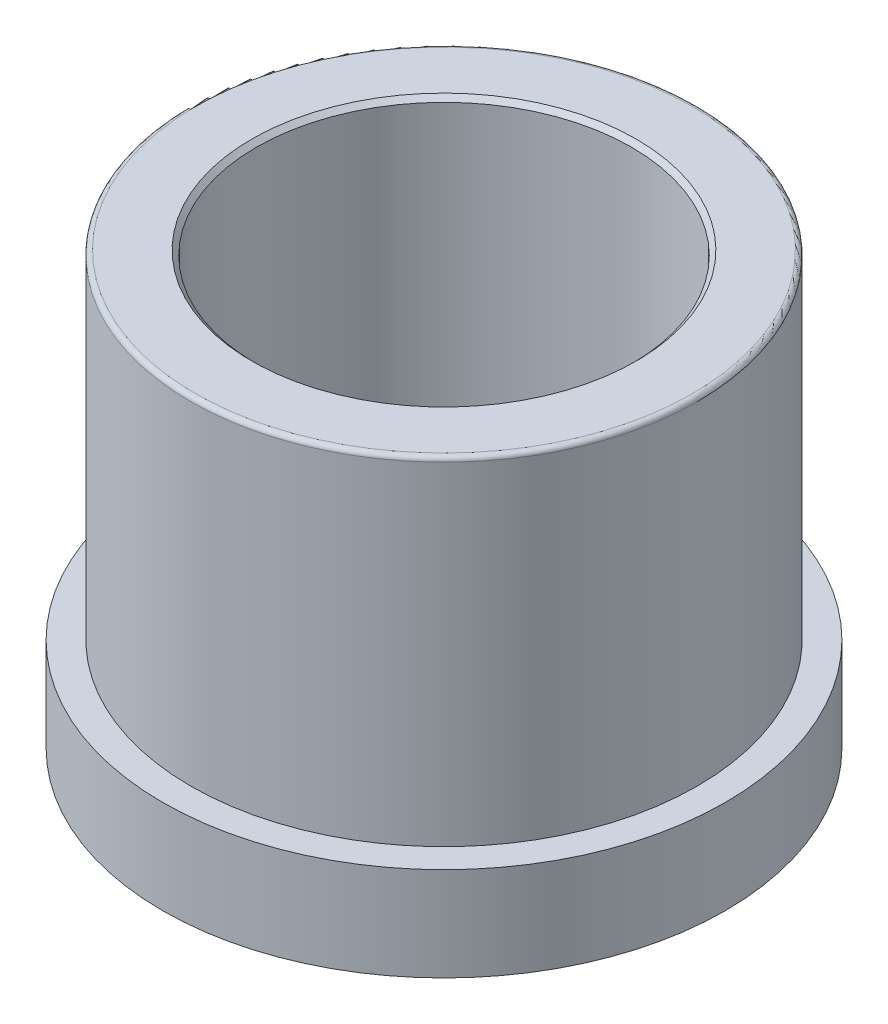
ISO-10303-21;
HEADER;
FILE_DESCRIPTION(('STEP AP214'),'2;1');
FILE_NAME('part.step','',(''),(''),'','','');
FILE_SCHEMA(('AUTOMOTIVE_DESIGN { 1 0 10303 214 1 1 1 1 }'));
ENDSEC;
DATA;
#1=APPLICATION_CONTEXT('core data for automotive mechanical design processes');
#2=APPLICATION_PROTOCOL_DEFINITION('international standard','automotive_design',2000,#1);
#3=PRODUCT_CONTEXT('',#1,'mechanical');
#4=PRODUCT('Part','Part','',(#3));
#5=PRODUCT_RELATED_PRODUCT_CATEGORY('part','',(#4));
#6=PRODUCT_DEFINITION_FORMATION('','',#4);
#7=PRODUCT_DEFINITION_CONTEXT('part definition',#1,'design');
#8=PRODUCT_DEFINITION('design','',#6,#7);
#9=PRODUCT_DEFINITION_SHAPE('','',#8);
#10=(LENGTH_UNIT() NAMED_UNIT(*) SI_UNIT(.MILLI.,.METRE.));
#11=(NAMED_UNIT(*) PLANE_ANGLE_UNIT() SI_UNIT($,.RADIAN.));
#12=(NAMED_UNIT(*) SI_UNIT($,.STERADIAN.) SOLID_ANGLE_UNIT());
#13=UNCERTAINTY_MEASURE_WITH_UNIT(LENGTH_MEASURE(1.E-05),#10,'distance_accuracy_value','');
#14=(GEOMETRIC_REPRESENTATION_CONTEXT(3) GLOBAL_UNCERTAINTY_ASSIGNED_CONTEXT((#13)) GLOBAL_UNIT_ASSIGNED_CONTEXT((#10,
#11,#12)) REPRESENTATION_CONTEXT('',''));
#15=CARTESIAN_POINT('',(0.,0.,0.));
#16=DIRECTION('',(0.,0.,1.));
#17=DIRECTION('',(1.,0.,0.));
#18=AXIS2_PLACEMENT_3D('',#15,#16,#17);
#19=CARTESIAN_POINT('',(0.,0.,0.));
#20=DIRECTION('',(0.,-1.,0.));
#21=DIRECTION('',(0.,0.,-1.));
#22=AXIS2_PLACEMENT_3D('',#19,#20,#21);
#23=CYLINDRICAL_SURFACE('',#22,27.);
#24=CARTESIAN_POINT('',(0.,35.5,0.));
#25=DIRECTION('',(0.,-1.,0.));
#26=DIRECTION('',(0.,0.,-1.));
#27=AXIS2_PLACEMENT_3D('',#24,#25,#26);
#28=CIRCLE('',#27,27.);
#29=CARTESIAN_POINT('',(0.,35.5,-27.));
#30=VERTEX_POINT('',#29);
#31=EDGE_CURVE('E20',#30,#30,#28,.T.);
#32=ORIENTED_EDGE('',*,*,#31,.T.);
#33=EDGE_LOOP('',(#32));
#34=FACE_BOUND('',#33,.T.);
#35=CARTESIAN_POINT('',(0.,0.,0.));
#36=DIRECTION('',(0.,-1.,0.));
#37=DIRECTION('',(0.,0.,-1.));
#38=AXIS2_PLACEMENT_3D('',#35,#36,#37);
#39=CIRCLE('',#38,27.);
#40=CARTESIAN_POINT('',(0.,0.,-27.));
#41=VERTEX_POINT('',#40);
#42=EDGE_CURVE('E48',#41,#41,#39,.T.);
#43=ORIENTED_EDGE('',*,*,#42,.F.);
#44=EDGE_LOOP('',(#43));
#45=FACE_BOUND('',#44,.T.);
#46=ADVANCED_FACE('F13',(#34,#45),#23,.T.);
#47=CARTESIAN_POINT('',(-27.,36.,0.));
#48=DIRECTION('',(0.,-1.,0.));
#49=DIRECTION('',(0.,0.,-1.));
#50=AXIS2_PLACEMENT_3D('',#47,#48,#49);
#51=PLANE('',#50);
#52=CARTESIAN_POINT('',(0.,36.,0.));
#53=DIRECTION('',(0.,-1.,0.));
#54=DIRECTION('',(0.,0.,-1.));
#55=AXIS2_PLACEMENT_3D('',#52,#53,#54);
#56=CIRCLE('',#55,26.5);
#57=CARTESIAN_POINT('',(0.,36.,-26.5));
#58=VERTEX_POINT('',#57);
#59=EDGE_CURVE('E8',#58,#58,#56,.F.);
#60=ORIENTED_EDGE('',*,*,#59,.T.);
#61=EDGE_LOOP('',(#60));
#62=FACE_BOUND('',#61,.T.);
#63=CARTESIAN_POINT('',(0.,36.,0.));
#64=DIRECTION('',(0.,-1.,0.));
#65=DIRECTION('',(0.,0.,-1.));
#66=AXIS2_PLACEMENT_3D('',#63,#64,#65);
#67=CIRCLE('',#66,20.5);
#68=CARTESIAN_POINT('',(0.,36.,-20.5));
#69=VERTEX_POINT('',#68);
#70=EDGE_CURVE('E36',#69,#69,#67,.T.);
#71=ORIENTED_EDGE('',*,*,#70,.T.);
#72=EDGE_LOOP('',(#71));
#73=FACE_BOUND('',#72,.T.);
#74=ADVANCED_FACE('F55',(#62,#73),#51,.F.);
#75=CARTESIAN_POINT('',(0.,0.,0.));
#76=DIRECTION('',(0.,-1.,0.));
#77=DIRECTION('',(0.,0.,-1.));
#78=AXIS2_PLACEMENT_3D('',#75,#76,#77);
#79=CYLINDRICAL_SURFACE('',#78,20.);
#80=CARTESIAN_POINT('',(0.,35.5,0.));
#81=DIRECTION('',(0.,-1.,0.));
#82=DIRECTION('',(0.,0.,-1.));
#83=AXIS2_PLACEMENT_3D('',#80,#81,#82);
#84=CIRCLE('',#83,20.);
#85=CARTESIAN_POINT('',(0.,35.5,-20.));
#86=VERTEX_POINT('',#85);
#87=EDGE_CURVE('E33',#86,#86,#84,.F.);
#88=ORIENTED_EDGE('',*,*,#87,.T.);
#89=EDGE_LOOP('',(#88));
#90=FACE_BOUND('',#89,.T.);
#91=CARTESIAN_POINT('',(0.,-10.,0.));
#92=DIRECTION('',(0.,-1.,0.));
#93=DIRECTION('',(0.,0.,-1.));
#94=AXIS2_PLACEMENT_3D('',#91,#92,#93);
#95=CIRCLE('',#94,20.);
#96=CARTESIAN_POINT('',(0.,-10.,-20.));
#97=VERTEX_POINT('',#96);
#98=EDGE_CURVE('E39',#97,#97,#95,.T.);
#99=ORIENTED_EDGE('',*,*,#98,.T.);
#100=EDGE_LOOP('',(#99));
#101=FACE_BOUND('',#100,.T.);
#102=ADVANCED_FACE('F62',(#90,#101),#79,.F.);
#103=CARTESIAN_POINT('',(0.,-10.15,0.));
#104=DIRECTION('',(0.,-1.,0.));
#105=DIRECTION('',(0.,0.,-1.));
#106=AXIS2_PLACEMENT_3D('',#103,#104,#105);
#107=CONICAL_SURFACE('',#106,20.1,0.588002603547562);
#108=CARTESIAN_POINT('',(0.,-10.36,0.));
#109=DIRECTION('',(0.,1.,0.));
#110=DIRECTION('',(0.,0.,1.));
#111=AXIS2_PLACEMENT_3D('',#108,#109,#110);
#112=CIRCLE('',#111,20.24);
#113=CARTESIAN_POINT('',(0.,-10.36,20.24));
#114=VERTEX_POINT('',#113);
#115=EDGE_CURVE('E24',#114,#114,#112,.F.);
#116=ORIENTED_EDGE('',*,*,#115,.T.);
#117=EDGE_LOOP('',(#116));
#118=FACE_BOUND('',#117,.T.);
#119=ORIENTED_EDGE('',*,*,#98,.F.);
#120=EDGE_LOOP('',(#119));
#121=FACE_BOUND('',#120,.T.);
#122=ADVANCED_FACE('F81',(#118,#121),#107,.F.);
#123=CARTESIAN_POINT('',(-20.1,-10.,0.));
#124=DIRECTION('',(0.,1.,0.));
#125=DIRECTION('',(0.,0.,1.));
#126=AXIS2_PLACEMENT_3D('',#123,#124,#125);
#127=PLANE('',#126);
#128=CARTESIAN_POINT('',(0.,-10.,0.));
#129=DIRECTION('',(0.,1.,0.));
#130=DIRECTION('',(0.,0.,1.));
#131=AXIS2_PLACEMENT_3D('',#128,#129,#130);
#132=CIRCLE('',#131,20.6);
#133=CARTESIAN_POINT('',(0.,-10.,20.6));
#134=VERTEX_POINT('',#133);
#135=EDGE_CURVE('E28',#134,#134,#132,.T.);
#136=ORIENTED_EDGE('',*,*,#135,.T.);
#137=EDGE_LOOP('',(#136));
#138=FACE_BOUND('',#137,.T.);
#139=CARTESIAN_POINT('',(0.,-10.,0.));
#140=DIRECTION('',(0.,-1.,0.));
#141=DIRECTION('',(0.,0.,-1.));
#142=AXIS2_PLACEMENT_3D('',#139,#140,#141);
#143=CIRCLE('',#142,30.);
#144=CARTESIAN_POINT('',(0.,-10.,-30.));
#145=VERTEX_POINT('',#144);
#146=EDGE_CURVE('E42',#145,#145,#143,.T.);
#147=ORIENTED_EDGE('',*,*,#146,.T.);
#148=EDGE_LOOP('',(#147));
#149=FACE_BOUND('',#148,.T.);
#150=ADVANCED_FACE('F84',(#138,#149),#127,.F.);
#151=CARTESIAN_POINT('',(0.,0.,0.));
#152=DIRECTION('',(0.,-1.,0.));
#153=DIRECTION('',(0.,0.,-1.));
#154=AXIS2_PLACEMENT_3D('',#151,#152,#153);
#155=CYLINDRICAL_SURFACE('',#154,30.);
#156=ORIENTED_EDGE('',*,*,#146,.F.);
#157=EDGE_LOOP('',(#156));
#158=FACE_BOUND('',#157,.T.);
#159=CARTESIAN_POINT('',(0.,0.,0.));
#160=DIRECTION('',(0.,-1.,0.));
#161=DIRECTION('',(0.,0.,-1.));
#162=AXIS2_PLACEMENT_3D('',#159,#160,#161);
#163=CIRCLE('',#162,30.);
#164=CARTESIAN_POINT('',(0.,0.,-30.));
#165=VERTEX_POINT('',#164);
#166=EDGE_CURVE('E45',#165,#165,#163,.T.);
#167=ORIENTED_EDGE('',*,*,#166,.T.);
#168=EDGE_LOOP('',(#167));
#169=FACE_BOUND('',#168,.T.);
#170=ADVANCED_FACE('F96',(#158,#169),#155,.T.);
#171=CARTESIAN_POINT('',(-30.,0.,0.));
#172=DIRECTION('',(0.,-1.,0.));
#173=DIRECTION('',(0.,0.,-1.));
#174=AXIS2_PLACEMENT_3D('',#171,#172,#173);
#175=PLANE('',#174);
#176=ORIENTED_EDGE('',*,*,#166,.F.);
#177=EDGE_LOOP('',(#176));
#178=FACE_BOUND('',#177,.T.);
#179=ORIENTED_EDGE('',*,*,#42,.T.);
#180=EDGE_LOOP('',(#179));
#181=FACE_BOUND('',#180,.T.);
#182=ADVANCED_FACE('F52',(#178,#181),#175,.F.);
#183=CARTESIAN_POINT('',(0.,36.,0.));
#184=DIRECTION('',(0.,1.,0.));
#185=DIRECTION('',(0.,0.,1.));
#186=AXIS2_PLACEMENT_3D('',#183,#184,#185);
#187=CONICAL_SURFACE('',#186,20.5,0.785398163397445);
#188=ORIENTED_EDGE('',*,*,#87,.F.);
#189=EDGE_LOOP('',(#188));
#190=FACE_BOUND('',#189,.T.);
#191=ORIENTED_EDGE('',*,*,#70,.F.);
#192=EDGE_LOOP('',(#191));
#193=FACE_BOUND('',#192,.T.);
#194=ADVANCED_FACE('F66',(#190,#193),#187,.F.);
#195=CARTESIAN_POINT('',(0.,-10.5,0.));
#196=DIRECTION('',(0.,1.,0.));
#197=DIRECTION('',(0.,0.,1.));
#198=AXIS2_PLACEMENT_3D('',#195,#196,#197);
#199=CONICAL_SURFACE('',#198,20.1,0.785398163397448);
#200=ORIENTED_EDGE('',*,*,#135,.F.);
#201=EDGE_LOOP('',(#200));
#202=FACE_BOUND('',#201,.T.);
#203=ORIENTED_EDGE('',*,*,#115,.F.);
#204=EDGE_LOOP('',(#203));
#205=FACE_BOUND('',#204,.T.);
#206=ADVANCED_FACE('F68',(#202,#205),#199,.T.);
#207=CARTESIAN_POINT('',(0.,35.5,0.));
#208=DIRECTION('',(0.,-1.,0.));
#209=DIRECTION('',(0.,0.,-1.));
#210=AXIS2_PLACEMENT_3D('',#207,#208,#209);
#211=TOROIDAL_SURFACE('',#210,26.5,0.5);
#212=ORIENTED_EDGE('',*,*,#59,.F.);
#213=EDGE_LOOP('',(#212));
#214=FACE_BOUND('',#213,.T.);
#215=ORIENTED_EDGE('',*,*,#31,.F.);
#216=EDGE_LOOP('',(#215));
#217=FACE_BOUND('',#216,.T.);
#218=ADVANCED_FACE('F15',(#214,#217),#211,.T.);
#219=CLOSED_SHELL('',(#46,#74,#102,#122,#150,#170,#182,#194,#206,#218));
#220=MANIFOLD_SOLID_BREP('B1',#219);
#221=ADVANCED_BREP_SHAPE_REPRESENTATION('',(#18,#220),#14);
#222=SHAPE_DEFINITION_REPRESENTATION(#9,#221);
ENDSEC;
END-ISO-10303-21;
